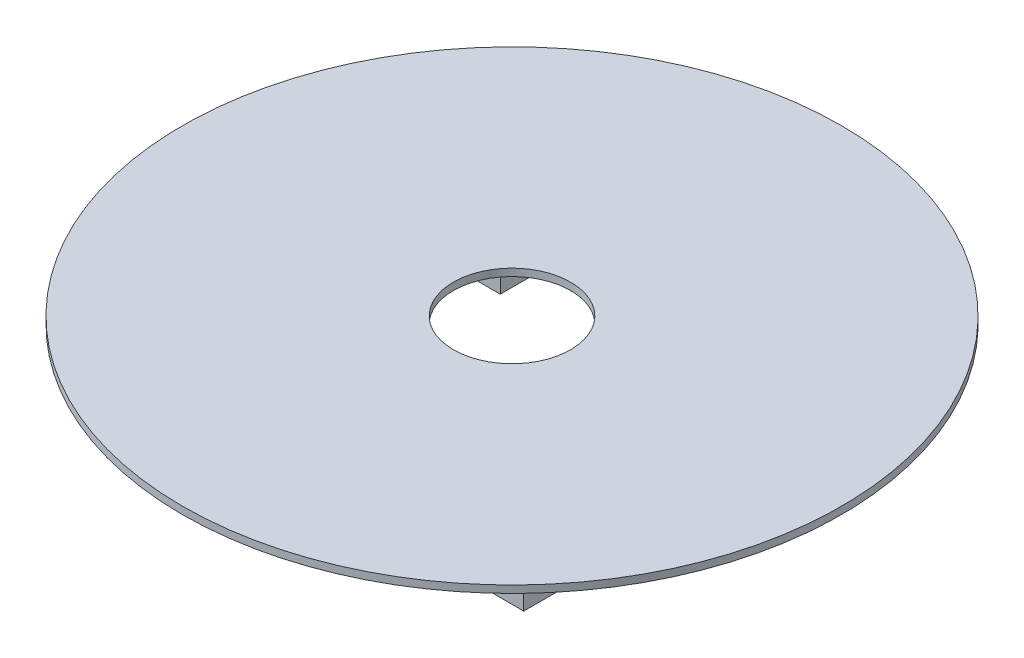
ISO-10303-21;
HEADER;
FILE_DESCRIPTION(('STEP AP214'),'2;1');
FILE_NAME('part.step','',(''),(''),'','','');
FILE_SCHEMA(('AUTOMOTIVE_DESIGN { 1 0 10303 214 1 1 1 1 }'));
ENDSEC;
DATA;
#1=APPLICATION_CONTEXT('core data for automotive mechanical design processes');
#2=APPLICATION_PROTOCOL_DEFINITION('international standard','automotive_design',2000,#1);
#3=PRODUCT_CONTEXT('',#1,'mechanical');
#4=PRODUCT('Part','Part','',(#3));
#5=PRODUCT_RELATED_PRODUCT_CATEGORY('part','',(#4));
#6=PRODUCT_DEFINITION_FORMATION('','',#4);
#7=PRODUCT_DEFINITION_CONTEXT('part definition',#1,'design');
#8=PRODUCT_DEFINITION('design','',#6,#7);
#9=PRODUCT_DEFINITION_SHAPE('','',#8);
#10=(LENGTH_UNIT() NAMED_UNIT(*) SI_UNIT(.MILLI.,.METRE.));
#11=(NAMED_UNIT(*) PLANE_ANGLE_UNIT() SI_UNIT($,.RADIAN.));
#12=(NAMED_UNIT(*) SI_UNIT($,.STERADIAN.) SOLID_ANGLE_UNIT());
#13=UNCERTAINTY_MEASURE_WITH_UNIT(LENGTH_MEASURE(1.E-05),#10,'distance_accuracy_value','');
#14=(GEOMETRIC_REPRESENTATION_CONTEXT(3) GLOBAL_UNCERTAINTY_ASSIGNED_CONTEXT((#13)) GLOBAL_UNIT_ASSIGNED_CONTEXT((#10,
#11,#12)) REPRESENTATION_CONTEXT('',''));
#15=CARTESIAN_POINT('',(0.,0.,0.));
#16=DIRECTION('',(0.,0.,1.));
#17=DIRECTION('',(1.,0.,0.));
#18=AXIS2_PLACEMENT_3D('',#15,#16,#17);
#19=CARTESIAN_POINT('',(0.,100.,0.));
#20=DIRECTION('',(0.,1.,0.));
#21=DIRECTION('',(0.,0.,1.));
#22=AXIS2_PLACEMENT_3D('',#19,#20,#21);
#23=PLANE('',#22);
#24=CARTESIAN_POINT('',(0.,100.,0.));
#25=DIRECTION('',(0.,1.,0.));
#26=DIRECTION('',(0.,0.,1.));
#27=AXIS2_PLACEMENT_3D('',#24,#25,#26);
#28=CIRCLE('',#27,4500.);
#29=CARTESIAN_POINT('',(0.,100.,4500.));
#30=VERTEX_POINT('',#29);
#31=EDGE_CURVE('E11',#30,#30,#28,.T.);
#32=ORIENTED_EDGE('',*,*,#31,.T.);
#33=EDGE_LOOP('',(#32));
#34=FACE_BOUND('',#33,.T.);
#35=CARTESIAN_POINT('',(0.,100.,0.));
#36=DIRECTION('',(0.,1.,0.));
#37=DIRECTION('',(0.,0.,1.));
#38=AXIS2_PLACEMENT_3D('',#35,#36,#37);
#39=CIRCLE('',#38,800.);
#40=CARTESIAN_POINT('',(0.,100.,800.));
#41=VERTEX_POINT('',#40);
#42=EDGE_CURVE('E290',#41,#41,#39,.T.);
#43=ORIENTED_EDGE('',*,*,#42,.F.);
#44=EDGE_LOOP('',(#43));
#45=FACE_BOUND('',#44,.T.);
#46=ADVANCED_FACE('F39',(#34,#45),#23,.T.);
#47=CARTESIAN_POINT('',(0.,0.,0.));
#48=DIRECTION('',(0.,1.,0.));
#49=DIRECTION('',(0.,0.,1.));
#50=AXIS2_PLACEMENT_3D('',#47,#48,#49);
#51=PLANE('',#50);
#52=DIRECTION('',(-1.,0.,0.));
#53=VECTOR('',#52,1.);
#54=CARTESIAN_POINT('',(627.106781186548,0.,787.106781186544));
#55=LINE('',#54,#53);
#56=CARTESIAN_POINT('',(3120.55915910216,0.,787.106781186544));
#57=VERTEX_POINT('',#56);
#58=CARTESIAN_POINT('',(627.106781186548,0.,787.106781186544));
#59=VERTEX_POINT('',#58);
#60=EDGE_CURVE('E232',#57,#59,#55,.T.);
#61=ORIENTED_EDGE('',*,*,#60,.T.);
#62=DIRECTION('',(0.,0.,1.));
#63=VECTOR('',#62,1.);
#64=CARTESIAN_POINT('',(627.106781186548,0.,787.106781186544));
#65=LINE('',#64,#63);
#66=CARTESIAN_POINT('',(627.106781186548,0.,2960.55915910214));
#67=VERTEX_POINT('',#66);
#68=EDGE_CURVE('E53',#59,#67,#65,.T.);
#69=ORIENTED_EDGE('',*,*,#68,.T.);
#70=DIRECTION('',(1.,0.,0.));
#71=VECTOR('',#70,1.);
#72=CARTESIAN_POINT('',(627.106781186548,0.,2960.55915910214));
#73=LINE('',#72,#71);
#74=CARTESIAN_POINT('',(3120.55915910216,0.,2960.55915910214));
#75=VERTEX_POINT('',#74);
#76=EDGE_CURVE('E238',#67,#75,#73,.T.);
#77=ORIENTED_EDGE('',*,*,#76,.T.);
#78=DIRECTION('',(0.,0.,-1.));
#79=VECTOR('',#78,1.);
#80=CARTESIAN_POINT('',(3120.55915910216,0.,787.106781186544));
#81=LINE('',#80,#79);
#82=EDGE_CURVE('E237',#75,#57,#81,.T.);
#83=ORIENTED_EDGE('',*,*,#82,.T.);
#84=EDGE_LOOP('',(#61,#69,#77,#83));
#85=FACE_BOUND('',#84,.T.);
#86=DIRECTION('',(1.,0.,0.));
#87=VECTOR('',#86,1.);
#88=CARTESIAN_POINT('',(-787.106781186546,0.,2960.55915910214));
#89=LINE('',#88,#87);
#90=CARTESIAN_POINT('',(-2960.55915910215,0.,2960.55915910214));
#91=VERTEX_POINT('',#90);
#92=CARTESIAN_POINT('',(-787.106781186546,0.,2960.55915910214));
#93=VERTEX_POINT('',#92);
#94=EDGE_CURVE('E201',#91,#93,#89,.T.);
#95=ORIENTED_EDGE('',*,*,#94,.T.);
#96=DIRECTION('',(0.,0.,-1.));
#97=VECTOR('',#96,1.);
#98=CARTESIAN_POINT('',(-787.106781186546,0.,787.106781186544));
#99=LINE('',#98,#97);
#100=CARTESIAN_POINT('',(-787.106781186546,0.,787.106781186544));
#101=VERTEX_POINT('',#100);
#102=EDGE_CURVE('E65',#93,#101,#99,.T.);
#103=ORIENTED_EDGE('',*,*,#102,.T.);
#104=DIRECTION('',(-1.,0.,0.));
#105=VECTOR('',#104,1.);
#106=CARTESIAN_POINT('',(-787.106781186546,0.,787.106781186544));
#107=LINE('',#106,#105);
#108=CARTESIAN_POINT('',(-2960.55915910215,0.,787.106781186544));
#109=VERTEX_POINT('',#108);
#110=EDGE_CURVE('E209',#101,#109,#107,.T.);
#111=ORIENTED_EDGE('',*,*,#110,.T.);
#112=DIRECTION('',(0.,0.,1.));
#113=VECTOR('',#112,1.);
#114=CARTESIAN_POINT('',(-2960.55915910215,0.,787.106781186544));
#115=LINE('',#114,#113);
#116=EDGE_CURVE('E206',#109,#91,#115,.T.);
#117=ORIENTED_EDGE('',*,*,#116,.T.);
#118=EDGE_LOOP('',(#95,#103,#111,#117));
#119=FACE_BOUND('',#118,.T.);
#120=DIRECTION('',(1.,0.,0.));
#121=VECTOR('',#120,1.);
#122=CARTESIAN_POINT('',(-787.106781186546,0.,-627.106781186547));
#123=LINE('',#122,#121);
#124=CARTESIAN_POINT('',(-2960.55915910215,0.,-627.106781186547));
#125=VERTEX_POINT('',#124);
#126=CARTESIAN_POINT('',(-787.106781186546,0.,-627.106781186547));
#127=VERTEX_POINT('',#126);
#128=EDGE_CURVE('E169',#125,#127,#123,.T.);
#129=ORIENTED_EDGE('',*,*,#128,.T.);
#130=DIRECTION('',(0.,0.,-1.));
#131=VECTOR('',#130,1.);
#132=CARTESIAN_POINT('',(-787.106781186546,0.,-627.106781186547));
#133=LINE('',#132,#131);
#134=CARTESIAN_POINT('',(-787.106781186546,0.,-3120.55915910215));
#135=VERTEX_POINT('',#134);
#136=EDGE_CURVE('E178',#127,#135,#133,.T.);
#137=ORIENTED_EDGE('',*,*,#136,.T.);
#138=DIRECTION('',(-1.,0.,0.));
#139=VECTOR('',#138,1.);
#140=CARTESIAN_POINT('',(-787.106781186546,0.,-3120.55915910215));
#141=LINE('',#140,#139);
#142=CARTESIAN_POINT('',(-2960.55915910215,0.,-3120.55915910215));
#143=VERTEX_POINT('',#142);
#144=EDGE_CURVE('E180',#135,#143,#141,.T.);
#145=ORIENTED_EDGE('',*,*,#144,.T.);
#146=DIRECTION('',(0.,0.,1.));
#147=VECTOR('',#146,1.);
#148=CARTESIAN_POINT('',(-2960.55915910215,0.,-627.106781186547));
#149=LINE('',#148,#147);
#150=EDGE_CURVE('E156',#143,#125,#149,.T.);
#151=ORIENTED_EDGE('',*,*,#150,.T.);
#152=EDGE_LOOP('',(#129,#137,#145,#151));
#153=FACE_BOUND('',#152,.T.);
#154=DIRECTION('',(-1.,0.,0.));
#155=VECTOR('',#154,1.);
#156=CARTESIAN_POINT('',(627.106781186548,0.,-3120.55915910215));
#157=LINE('',#156,#155);
#158=CARTESIAN_POINT('',(3120.55915910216,0.,-3120.55915910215));
#159=VERTEX_POINT('',#158);
#160=CARTESIAN_POINT('',(627.106781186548,0.,-3120.55915910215));
#161=VERTEX_POINT('',#160);
#162=EDGE_CURVE('E256',#159,#161,#157,.T.);
#163=ORIENTED_EDGE('',*,*,#162,.T.);
#164=DIRECTION('',(0.,0.,1.));
#165=VECTOR('',#164,1.);
#166=CARTESIAN_POINT('',(627.106781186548,0.,-627.106781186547));
#167=LINE('',#166,#165);
#168=CARTESIAN_POINT('',(627.106781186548,0.,-627.106781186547));
#169=VERTEX_POINT('',#168);
#170=EDGE_CURVE('E184',#161,#169,#167,.T.);
#171=ORIENTED_EDGE('',*,*,#170,.T.);
#172=DIRECTION('',(1.,0.,0.));
#173=VECTOR('',#172,1.);
#174=CARTESIAN_POINT('',(627.106781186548,0.,-627.106781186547));
#175=LINE('',#174,#173);
#176=CARTESIAN_POINT('',(3120.55915910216,0.,-627.106781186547));
#177=VERTEX_POINT('',#176);
#178=EDGE_CURVE('E269',#169,#177,#175,.T.);
#179=ORIENTED_EDGE('',*,*,#178,.T.);
#180=DIRECTION('',(0.,0.,-1.));
#181=VECTOR('',#180,1.);
#182=CARTESIAN_POINT('',(3120.55915910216,0.,-627.106781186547));
#183=LINE('',#182,#181);
#184=EDGE_CURVE('E272',#177,#159,#183,.T.);
#185=ORIENTED_EDGE('',*,*,#184,.T.);
#186=EDGE_LOOP('',(#163,#171,#179,#185));
#187=FACE_BOUND('',#186,.T.);
#188=CARTESIAN_POINT('',(0.,0.,0.));
#189=DIRECTION('',(0.,1.,0.));
#190=DIRECTION('',(0.,0.,1.));
#191=AXIS2_PLACEMENT_3D('',#188,#189,#190);
#192=CIRCLE('',#191,4500.);
#193=CARTESIAN_POINT('',(0.,0.,4500.));
#194=VERTEX_POINT('',#193);
#195=EDGE_CURVE('E43',#194,#194,#192,.T.);
#196=ORIENTED_EDGE('',*,*,#195,.F.);
#197=EDGE_LOOP('',(#196));
#198=FACE_BOUND('',#197,.T.);
#199=CARTESIAN_POINT('',(0.,0.,0.));
#200=DIRECTION('',(0.,1.,0.));
#201=DIRECTION('',(0.,0.,1.));
#202=AXIS2_PLACEMENT_3D('',#199,#200,#201);
#203=CIRCLE('',#202,800.);
#204=CARTESIAN_POINT('',(0.,0.,800.));
#205=VERTEX_POINT('',#204);
#206=EDGE_CURVE('E281',#205,#205,#203,.T.);
#207=ORIENTED_EDGE('',*,*,#206,.T.);
#208=EDGE_LOOP('',(#207));
#209=FACE_BOUND('',#208,.T.);
#210=ADVANCED_FACE('F173',(#85,#119,#153,#187,#198,#209),#51,.F.);
#211=CARTESIAN_POINT('',(0.,100.,0.));
#212=DIRECTION('',(0.,-1.,0.));
#213=DIRECTION('',(0.,0.,-1.));
#214=AXIS2_PLACEMENT_3D('',#211,#212,#213);
#215=CYLINDRICAL_SURFACE('',#214,4500.);
#216=ORIENTED_EDGE('',*,*,#31,.F.);
#217=EDGE_LOOP('',(#216));
#218=FACE_BOUND('',#217,.T.);
#219=ORIENTED_EDGE('',*,*,#195,.T.);
#220=EDGE_LOOP('',(#219));
#221=FACE_BOUND('',#220,.T.);
#222=ADVANCED_FACE('F41',(#218,#221),#215,.T.);
#223=CARTESIAN_POINT('',(0.,100.,0.));
#224=DIRECTION('',(0.,-1.,0.));
#225=DIRECTION('',(0.,0.,-1.));
#226=AXIS2_PLACEMENT_3D('',#223,#224,#225);
#227=CYLINDRICAL_SURFACE('',#226,800.);
#228=ORIENTED_EDGE('',*,*,#42,.T.);
#229=EDGE_LOOP('',(#228));
#230=FACE_BOUND('',#229,.T.);
#231=ORIENTED_EDGE('',*,*,#206,.F.);
#232=EDGE_LOOP('',(#231));
#233=FACE_BOUND('',#232,.T.);
#234=ADVANCED_FACE('F294',(#230,#233),#227,.F.);
#235=CARTESIAN_POINT('',(627.106781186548,-350.,-627.106781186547));
#236=DIRECTION('',(-1.,0.,0.));
#237=DIRECTION('',(0.,0.,1.));
#238=AXIS2_PLACEMENT_3D('',#235,#236,#237);
#239=PLANE('',#238);
#240=ORIENTED_EDGE('',*,*,#170,.F.);
#241=DIRECTION('',(0.,1.,0.));
#242=VECTOR('',#241,1.);
#243=CARTESIAN_POINT('',(627.106781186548,-350.,-3120.55915910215));
#244=LINE('',#243,#242);
#245=CARTESIAN_POINT('',(627.106781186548,-350.,-3120.55915910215));
#246=VERTEX_POINT('',#245);
#247=EDGE_CURVE('E279',#246,#161,#244,.T.);
#248=ORIENTED_EDGE('',*,*,#247,.F.);
#249=DIRECTION('',(0.,0.,1.));
#250=VECTOR('',#249,1.);
#251=CARTESIAN_POINT('',(627.106781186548,-350.,-627.106781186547));
#252=LINE('',#251,#250);
#253=CARTESIAN_POINT('',(627.106781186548,-350.,-627.106781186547));
#254=VERTEX_POINT('',#253);
#255=EDGE_CURVE('E255',#246,#254,#252,.T.);
#256=ORIENTED_EDGE('',*,*,#255,.T.);
#257=DIRECTION('',(0.,1.,0.));
#258=VECTOR('',#257,1.);
#259=CARTESIAN_POINT('',(627.106781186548,-350.,-627.106781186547));
#260=LINE('',#259,#258);
#261=EDGE_CURVE('E270',#254,#169,#260,.T.);
#262=ORIENTED_EDGE('',*,*,#261,.T.);
#263=EDGE_LOOP('',(#240,#248,#256,#262));
#264=FACE_BOUND('',#263,.T.);
#265=ADVANCED_FACE('F296',(#264),#239,.T.);
#266=CARTESIAN_POINT('',(627.106781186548,-350.,-3120.55915910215));
#267=DIRECTION('',(0.,0.,-1.));
#268=DIRECTION('',(-1.,0.,0.));
#269=AXIS2_PLACEMENT_3D('',#266,#267,#268);
#270=PLANE('',#269);
#271=ORIENTED_EDGE('',*,*,#162,.F.);
#272=DIRECTION('',(0.,1.,0.));
#273=VECTOR('',#272,1.);
#274=CARTESIAN_POINT('',(3120.55915910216,-350.,-3120.55915910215));
#275=LINE('',#274,#273);
#276=CARTESIAN_POINT('',(3120.55915910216,-350.,-3120.55915910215));
#277=VERTEX_POINT('',#276);
#278=EDGE_CURVE('E285',#277,#159,#275,.T.);
#279=ORIENTED_EDGE('',*,*,#278,.F.);
#280=DIRECTION('',(-1.,0.,0.));
#281=VECTOR('',#280,1.);
#282=CARTESIAN_POINT('',(627.106781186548,-350.,-3120.55915910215));
#283=LINE('',#282,#281);
#284=EDGE_CURVE('E262',#277,#246,#283,.T.);
#285=ORIENTED_EDGE('',*,*,#284,.T.);
#286=ORIENTED_EDGE('',*,*,#247,.T.);
#287=EDGE_LOOP('',(#271,#279,#285,#286));
#288=FACE_BOUND('',#287,.T.);
#289=ADVANCED_FACE('F303',(#288),#270,.T.);
#290=CARTESIAN_POINT('',(3120.55915910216,-350.,-627.106781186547));
#291=DIRECTION('',(1.,0.,0.));
#292=DIRECTION('',(0.,0.,-1.));
#293=AXIS2_PLACEMENT_3D('',#290,#291,#292);
#294=PLANE('',#293);
#295=ORIENTED_EDGE('',*,*,#184,.F.);
#296=DIRECTION('',(0.,1.,0.));
#297=VECTOR('',#296,1.);
#298=CARTESIAN_POINT('',(3120.55915910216,-350.,-627.106781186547));
#299=LINE('',#298,#297);
#300=CARTESIAN_POINT('',(3120.55915910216,-350.,-627.106781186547));
#301=VERTEX_POINT('',#300);
#302=EDGE_CURVE('E283',#301,#177,#299,.T.);
#303=ORIENTED_EDGE('',*,*,#302,.F.);
#304=DIRECTION('',(0.,0.,-1.));
#305=VECTOR('',#304,1.);
#306=CARTESIAN_POINT('',(3120.55915910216,-350.,-627.106781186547));
#307=LINE('',#306,#305);
#308=EDGE_CURVE('E261',#301,#277,#307,.T.);
#309=ORIENTED_EDGE('',*,*,#308,.T.);
#310=ORIENTED_EDGE('',*,*,#278,.T.);
#311=EDGE_LOOP('',(#295,#303,#309,#310));
#312=FACE_BOUND('',#311,.T.);
#313=ADVANCED_FACE('F379',(#312),#294,.T.);
#314=CARTESIAN_POINT('',(627.106781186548,-350.,-627.106781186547));
#315=DIRECTION('',(0.,0.,1.));
#316=DIRECTION('',(1.,0.,0.));
#317=AXIS2_PLACEMENT_3D('',#314,#315,#316);
#318=PLANE('',#317);
#319=ORIENTED_EDGE('',*,*,#178,.F.);
#320=ORIENTED_EDGE('',*,*,#261,.F.);
#321=DIRECTION('',(1.,0.,0.));
#322=VECTOR('',#321,1.);
#323=CARTESIAN_POINT('',(627.106781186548,-350.,-627.106781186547));
#324=LINE('',#323,#322);
#325=EDGE_CURVE('E260',#254,#301,#324,.T.);
#326=ORIENTED_EDGE('',*,*,#325,.T.);
#327=ORIENTED_EDGE('',*,*,#302,.T.);
#328=EDGE_LOOP('',(#319,#320,#326,#327));
#329=FACE_BOUND('',#328,.T.);
#330=ADVANCED_FACE('F376',(#329),#318,.T.);
#331=CARTESIAN_POINT('',(0.,-350.,0.));
#332=DIRECTION('',(0.,-1.,0.));
#333=DIRECTION('',(0.,0.,-1.));
#334=AXIS2_PLACEMENT_3D('',#331,#332,#333);
#335=PLANE('',#334);
#336=ORIENTED_EDGE('',*,*,#255,.F.);
#337=ORIENTED_EDGE('',*,*,#284,.F.);
#338=ORIENTED_EDGE('',*,*,#308,.F.);
#339=ORIENTED_EDGE('',*,*,#325,.F.);
#340=EDGE_LOOP('',(#336,#337,#338,#339));
#341=FACE_BOUND('',#340,.T.);
#342=ADVANCED_FACE('F375',(#341),#335,.T.);
#343=CARTESIAN_POINT('',(-787.106781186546,-350.,-627.106781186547));
#344=DIRECTION('',(1.,0.,0.));
#345=DIRECTION('',(0.,0.,-1.));
#346=AXIS2_PLACEMENT_3D('',#343,#344,#345);
#347=PLANE('',#346);
#348=ORIENTED_EDGE('',*,*,#136,.F.);
#349=DIRECTION('',(0.,1.,0.));
#350=VECTOR('',#349,1.);
#351=CARTESIAN_POINT('',(-787.106781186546,-350.,-627.106781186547));
#352=LINE('',#351,#350);
#353=CARTESIAN_POINT('',(-787.106781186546,-350.,-627.106781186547));
#354=VERTEX_POINT('',#353);
#355=EDGE_CURVE('E163',#354,#127,#352,.T.);
#356=ORIENTED_EDGE('',*,*,#355,.F.);
#357=DIRECTION('',(0.,0.,-1.));
#358=VECTOR('',#357,1.);
#359=CARTESIAN_POINT('',(-787.106781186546,-350.,-627.106781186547));
#360=LINE('',#359,#358);
#361=CARTESIAN_POINT('',(-787.106781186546,-350.,-3120.55915910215));
#362=VERTEX_POINT('',#361);
#363=EDGE_CURVE('E175',#354,#362,#360,.T.);
#364=ORIENTED_EDGE('',*,*,#363,.T.);
#365=DIRECTION('',(0.,1.,0.));
#366=VECTOR('',#365,1.);
#367=CARTESIAN_POINT('',(-787.106781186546,-350.,-3120.55915910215));
#368=LINE('',#367,#366);
#369=EDGE_CURVE('E190',#362,#135,#368,.T.);
#370=ORIENTED_EDGE('',*,*,#369,.T.);
#371=EDGE_LOOP('',(#348,#356,#364,#370));
#372=FACE_BOUND('',#371,.T.);
#373=ADVANCED_FACE('F374',(#372),#347,.T.);
#374=CARTESIAN_POINT('',(-787.106781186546,-350.,-627.106781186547));
#375=DIRECTION('',(0.,0.,1.));
#376=DIRECTION('',(1.,0.,0.));
#377=AXIS2_PLACEMENT_3D('',#374,#375,#376);
#378=PLANE('',#377);
#379=ORIENTED_EDGE('',*,*,#128,.F.);
#380=DIRECTION('',(0.,1.,0.));
#381=VECTOR('',#380,1.);
#382=CARTESIAN_POINT('',(-2960.55915910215,-350.,-627.106781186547));
#383=LINE('',#382,#381);
#384=CARTESIAN_POINT('',(-2960.55915910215,-350.,-627.106781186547));
#385=VERTEX_POINT('',#384);
#386=EDGE_CURVE('E155',#385,#125,#383,.T.);
#387=ORIENTED_EDGE('',*,*,#386,.F.);
#388=DIRECTION('',(1.,0.,0.));
#389=VECTOR('',#388,1.);
#390=CARTESIAN_POINT('',(-787.106781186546,-350.,-627.106781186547));
#391=LINE('',#390,#389);
#392=EDGE_CURVE('E183',#385,#354,#391,.T.);
#393=ORIENTED_EDGE('',*,*,#392,.T.);
#394=ORIENTED_EDGE('',*,*,#355,.T.);
#395=EDGE_LOOP('',(#379,#387,#393,#394));
#396=FACE_BOUND('',#395,.T.);
#397=ADVANCED_FACE('F166',(#396),#378,.T.);
#398=CARTESIAN_POINT('',(-2960.55915910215,-350.,-627.106781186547));
#399=DIRECTION('',(-1.,0.,0.));
#400=DIRECTION('',(0.,0.,1.));
#401=AXIS2_PLACEMENT_3D('',#398,#399,#400);
#402=PLANE('',#401);
#403=ORIENTED_EDGE('',*,*,#150,.F.);
#404=DIRECTION('',(0.,1.,0.));
#405=VECTOR('',#404,1.);
#406=CARTESIAN_POINT('',(-2960.55915910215,-350.,-3120.55915910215));
#407=LINE('',#406,#405);
#408=CARTESIAN_POINT('',(-2960.55915910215,-350.,-3120.55915910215));
#409=VERTEX_POINT('',#408);
#410=EDGE_CURVE('E162',#409,#143,#407,.T.);
#411=ORIENTED_EDGE('',*,*,#410,.F.);
#412=DIRECTION('',(0.,0.,1.));
#413=VECTOR('',#412,1.);
#414=CARTESIAN_POINT('',(-2960.55915910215,-350.,-627.106781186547));
#415=LINE('',#414,#413);
#416=EDGE_CURVE('E157',#409,#385,#415,.T.);
#417=ORIENTED_EDGE('',*,*,#416,.T.);
#418=ORIENTED_EDGE('',*,*,#386,.T.);
#419=EDGE_LOOP('',(#403,#411,#417,#418));
#420=FACE_BOUND('',#419,.T.);
#421=ADVANCED_FACE('F152',(#420),#402,.T.);
#422=CARTESIAN_POINT('',(-787.106781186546,-350.,-3120.55915910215));
#423=DIRECTION('',(0.,0.,-1.));
#424=DIRECTION('',(-1.,0.,0.));
#425=AXIS2_PLACEMENT_3D('',#422,#423,#424);
#426=PLANE('',#425);
#427=ORIENTED_EDGE('',*,*,#144,.F.);
#428=ORIENTED_EDGE('',*,*,#369,.F.);
#429=DIRECTION('',(-1.,0.,0.));
#430=VECTOR('',#429,1.);
#431=CARTESIAN_POINT('',(-787.106781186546,-350.,-3120.55915910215));
#432=LINE('',#431,#430);
#433=EDGE_CURVE('E188',#362,#409,#432,.T.);
#434=ORIENTED_EDGE('',*,*,#433,.T.);
#435=ORIENTED_EDGE('',*,*,#410,.T.);
#436=EDGE_LOOP('',(#427,#428,#434,#435));
#437=FACE_BOUND('',#436,.T.);
#438=ADVANCED_FACE('F422',(#437),#426,.T.);
#439=CARTESIAN_POINT('',(0.,-350.,0.));
#440=DIRECTION('',(0.,1.,0.));
#441=DIRECTION('',(0.,0.,1.));
#442=AXIS2_PLACEMENT_3D('',#439,#440,#441);
#443=PLANE('',#442);
#444=ORIENTED_EDGE('',*,*,#363,.F.);
#445=ORIENTED_EDGE('',*,*,#392,.F.);
#446=ORIENTED_EDGE('',*,*,#416,.F.);
#447=ORIENTED_EDGE('',*,*,#433,.F.);
#448=EDGE_LOOP('',(#444,#445,#446,#447));
#449=FACE_BOUND('',#448,.T.);
#450=ADVANCED_FACE('F433',(#449),#443,.F.);
#451=CARTESIAN_POINT('',(-787.106781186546,-350.,787.106781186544));
#452=DIRECTION('',(1.,0.,0.));
#453=DIRECTION('',(0.,0.,-1.));
#454=AXIS2_PLACEMENT_3D('',#451,#452,#453);
#455=PLANE('',#454);
#456=ORIENTED_EDGE('',*,*,#102,.F.);
#457=DIRECTION('',(0.,1.,0.));
#458=VECTOR('',#457,1.);
#459=CARTESIAN_POINT('',(-787.106781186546,-350.,2960.55915910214));
#460=LINE('',#459,#458);
#461=CARTESIAN_POINT('',(-787.106781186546,-350.,2960.55915910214));
#462=VERTEX_POINT('',#461);
#463=EDGE_CURVE('E203',#462,#93,#460,.T.);
#464=ORIENTED_EDGE('',*,*,#463,.F.);
#465=DIRECTION('',(0.,0.,-1.));
#466=VECTOR('',#465,1.);
#467=CARTESIAN_POINT('',(-787.106781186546,-350.,787.106781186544));
#468=LINE('',#467,#466);
#469=CARTESIAN_POINT('',(-787.106781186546,-350.,787.106781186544));
#470=VERTEX_POINT('',#469);
#471=EDGE_CURVE('E210',#462,#470,#468,.T.);
#472=ORIENTED_EDGE('',*,*,#471,.T.);
#473=DIRECTION('',(0.,1.,0.));
#474=VECTOR('',#473,1.);
#475=CARTESIAN_POINT('',(-787.106781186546,-350.,787.106781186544));
#476=LINE('',#475,#474);
#477=EDGE_CURVE('E193',#470,#101,#476,.T.);
#478=ORIENTED_EDGE('',*,*,#477,.T.);
#479=EDGE_LOOP('',(#456,#464,#472,#478));
#480=FACE_BOUND('',#479,.T.);
#481=ADVANCED_FACE('F332',(#480),#455,.T.);
#482=CARTESIAN_POINT('',(-787.106781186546,-350.,2960.55915910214));
#483=DIRECTION('',(0.,0.,1.));
#484=DIRECTION('',(1.,0.,0.));
#485=AXIS2_PLACEMENT_3D('',#482,#483,#484);
#486=PLANE('',#485);
#487=ORIENTED_EDGE('',*,*,#94,.F.);
#488=DIRECTION('',(0.,1.,0.));
#489=VECTOR('',#488,1.);
#490=CARTESIAN_POINT('',(-2960.55915910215,-350.,2960.55915910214));
#491=LINE('',#490,#489);
#492=CARTESIAN_POINT('',(-2960.55915910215,-350.,2960.55915910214));
#493=VERTEX_POINT('',#492);
#494=EDGE_CURVE('E200',#493,#91,#491,.T.);
#495=ORIENTED_EDGE('',*,*,#494,.F.);
#496=DIRECTION('',(1.,0.,0.));
#497=VECTOR('',#496,1.);
#498=CARTESIAN_POINT('',(-787.106781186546,-350.,2960.55915910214));
#499=LINE('',#498,#497);
#500=EDGE_CURVE('E198',#493,#462,#499,.T.);
#501=ORIENTED_EDGE('',*,*,#500,.T.);
#502=ORIENTED_EDGE('',*,*,#463,.T.);
#503=EDGE_LOOP('',(#487,#495,#501,#502));
#504=FACE_BOUND('',#503,.T.);
#505=ADVANCED_FACE('F327',(#504),#486,.T.);
#506=CARTESIAN_POINT('',(-2960.55915910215,-350.,787.106781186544));
#507=DIRECTION('',(-1.,0.,0.));
#508=DIRECTION('',(0.,0.,1.));
#509=AXIS2_PLACEMENT_3D('',#506,#507,#508);
#510=PLANE('',#509);
#511=ORIENTED_EDGE('',*,*,#116,.F.);
#512=DIRECTION('',(0.,1.,0.));
#513=VECTOR('',#512,1.);
#514=CARTESIAN_POINT('',(-2960.55915910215,-350.,787.106781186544));
#515=LINE('',#514,#513);
#516=CARTESIAN_POINT('',(-2960.55915910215,-350.,787.106781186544));
#517=VERTEX_POINT('',#516);
#518=EDGE_CURVE('E197',#517,#109,#515,.T.);
#519=ORIENTED_EDGE('',*,*,#518,.F.);
#520=DIRECTION('',(0.,0.,1.));
#521=VECTOR('',#520,1.);
#522=CARTESIAN_POINT('',(-2960.55915910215,-350.,787.106781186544));
#523=LINE('',#522,#521);
#524=EDGE_CURVE('E216',#517,#493,#523,.T.);
#525=ORIENTED_EDGE('',*,*,#524,.T.);
#526=ORIENTED_EDGE('',*,*,#494,.T.);
#527=EDGE_LOOP('',(#511,#519,#525,#526));
#528=FACE_BOUND('',#527,.T.);
#529=ADVANCED_FACE('F339',(#528),#510,.T.);
#530=CARTESIAN_POINT('',(-787.106781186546,-350.,787.106781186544));
#531=DIRECTION('',(0.,0.,-1.));
#532=DIRECTION('',(-1.,0.,0.));
#533=AXIS2_PLACEMENT_3D('',#530,#531,#532);
#534=PLANE('',#533);
#535=ORIENTED_EDGE('',*,*,#110,.F.);
#536=ORIENTED_EDGE('',*,*,#477,.F.);
#537=DIRECTION('',(-1.,0.,0.));
#538=VECTOR('',#537,1.);
#539=CARTESIAN_POINT('',(-787.106781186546,-350.,787.106781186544));
#540=LINE('',#539,#538);
#541=EDGE_CURVE('E218',#470,#517,#540,.T.);
#542=ORIENTED_EDGE('',*,*,#541,.T.);
#543=ORIENTED_EDGE('',*,*,#518,.T.);
#544=EDGE_LOOP('',(#535,#536,#542,#543));
#545=FACE_BOUND('',#544,.T.);
#546=ADVANCED_FACE('F337',(#545),#534,.T.);
#547=CARTESIAN_POINT('',(0.,-350.,0.));
#548=DIRECTION('',(0.,-1.,0.));
#549=DIRECTION('',(0.,0.,-1.));
#550=AXIS2_PLACEMENT_3D('',#547,#548,#549);
#551=PLANE('',#550);
#552=ORIENTED_EDGE('',*,*,#471,.F.);
#553=ORIENTED_EDGE('',*,*,#500,.F.);
#554=ORIENTED_EDGE('',*,*,#524,.F.);
#555=ORIENTED_EDGE('',*,*,#541,.F.);
#556=EDGE_LOOP('',(#552,#553,#554,#555));
#557=FACE_BOUND('',#556,.T.);
#558=ADVANCED_FACE('F331',(#557),#551,.T.);
#559=CARTESIAN_POINT('',(627.106781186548,-350.,787.106781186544));
#560=DIRECTION('',(-1.,0.,0.));
#561=DIRECTION('',(0.,0.,1.));
#562=AXIS2_PLACEMENT_3D('',#559,#560,#561);
#563=PLANE('',#562);
#564=ORIENTED_EDGE('',*,*,#68,.F.);
#565=DIRECTION('',(0.,1.,0.));
#566=VECTOR('',#565,1.);
#567=CARTESIAN_POINT('',(627.106781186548,-350.,787.106781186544));
#568=LINE('',#567,#566);
#569=CARTESIAN_POINT('',(627.106781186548,-350.,787.106781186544));
#570=VERTEX_POINT('',#569);
#571=EDGE_CURVE('E231',#570,#59,#568,.T.);
#572=ORIENTED_EDGE('',*,*,#571,.F.);
#573=DIRECTION('',(0.,0.,1.));
#574=VECTOR('',#573,1.);
#575=CARTESIAN_POINT('',(627.106781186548,-350.,787.106781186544));
#576=LINE('',#575,#574);
#577=CARTESIAN_POINT('',(627.106781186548,-350.,2960.55915910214));
#578=VERTEX_POINT('',#577);
#579=EDGE_CURVE('E240',#570,#578,#576,.T.);
#580=ORIENTED_EDGE('',*,*,#579,.T.);
#581=DIRECTION('',(0.,1.,0.));
#582=VECTOR('',#581,1.);
#583=CARTESIAN_POINT('',(627.106781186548,-350.,2960.55915910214));
#584=LINE('',#583,#582);
#585=EDGE_CURVE('E221',#578,#67,#584,.T.);
#586=ORIENTED_EDGE('',*,*,#585,.T.);
#587=EDGE_LOOP('',(#564,#572,#580,#586));
#588=FACE_BOUND('',#587,.T.);
#589=ADVANCED_FACE('F352',(#588),#563,.T.);
#590=CARTESIAN_POINT('',(627.106781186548,-350.,787.106781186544));
#591=DIRECTION('',(0.,0.,-1.));
#592=DIRECTION('',(-1.,0.,0.));
#593=AXIS2_PLACEMENT_3D('',#590,#591,#592);
#594=PLANE('',#593);
#595=ORIENTED_EDGE('',*,*,#60,.F.);
#596=DIRECTION('',(0.,1.,0.));
#597=VECTOR('',#596,1.);
#598=CARTESIAN_POINT('',(3120.55915910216,-350.,787.106781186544));
#599=LINE('',#598,#597);
#600=CARTESIAN_POINT('',(3120.55915910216,-350.,787.106781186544));
#601=VERTEX_POINT('',#600);
#602=EDGE_CURVE('E228',#601,#57,#599,.T.);
#603=ORIENTED_EDGE('',*,*,#602,.F.);
#604=DIRECTION('',(-1.,0.,0.));
#605=VECTOR('',#604,1.);
#606=CARTESIAN_POINT('',(627.106781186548,-350.,787.106781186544));
#607=LINE('',#606,#605);
#608=EDGE_CURVE('E226',#601,#570,#607,.T.);
#609=ORIENTED_EDGE('',*,*,#608,.T.);
#610=ORIENTED_EDGE('',*,*,#571,.T.);
#611=EDGE_LOOP('',(#595,#603,#609,#610));
#612=FACE_BOUND('',#611,.T.);
#613=ADVANCED_FACE('F356',(#612),#594,.T.);
#614=CARTESIAN_POINT('',(3120.55915910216,-350.,787.106781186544));
#615=DIRECTION('',(1.,0.,0.));
#616=DIRECTION('',(0.,0.,-1.));
#617=AXIS2_PLACEMENT_3D('',#614,#615,#616);
#618=PLANE('',#617);
#619=ORIENTED_EDGE('',*,*,#82,.F.);
#620=DIRECTION('',(0.,1.,0.));
#621=VECTOR('',#620,1.);
#622=CARTESIAN_POINT('',(3120.55915910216,-350.,2960.55915910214));
#623=LINE('',#622,#621);
#624=CARTESIAN_POINT('',(3120.55915910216,-350.,2960.55915910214));
#625=VERTEX_POINT('',#624);
#626=EDGE_CURVE('E230',#625,#75,#623,.T.);
#627=ORIENTED_EDGE('',*,*,#626,.F.);
#628=DIRECTION('',(0.,0.,-1.));
#629=VECTOR('',#628,1.);
#630=CARTESIAN_POINT('',(3120.55915910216,-350.,787.106781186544));
#631=LINE('',#630,#629);
#632=EDGE_CURVE('E246',#625,#601,#631,.T.);
#633=ORIENTED_EDGE('',*,*,#632,.T.);
#634=ORIENTED_EDGE('',*,*,#602,.T.);
#635=EDGE_LOOP('',(#619,#627,#633,#634));
#636=FACE_BOUND('',#635,.T.);
#637=ADVANCED_FACE('F363',(#636),#618,.T.);
#638=CARTESIAN_POINT('',(627.106781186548,-350.,2960.55915910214));
#639=DIRECTION('',(0.,0.,1.));
#640=DIRECTION('',(1.,0.,0.));
#641=AXIS2_PLACEMENT_3D('',#638,#639,#640);
#642=PLANE('',#641);
#643=ORIENTED_EDGE('',*,*,#76,.F.);
#644=ORIENTED_EDGE('',*,*,#585,.F.);
#645=DIRECTION('',(1.,0.,0.));
#646=VECTOR('',#645,1.);
#647=CARTESIAN_POINT('',(627.106781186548,-350.,2960.55915910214));
#648=LINE('',#647,#646);
#649=EDGE_CURVE('E248',#578,#625,#648,.T.);
#650=ORIENTED_EDGE('',*,*,#649,.T.);
#651=ORIENTED_EDGE('',*,*,#626,.T.);
#652=EDGE_LOOP('',(#643,#644,#650,#651));
#653=FACE_BOUND('',#652,.T.);
#654=ADVANCED_FACE('F360',(#653),#642,.T.);
#655=CARTESIAN_POINT('',(0.,-350.,0.));
#656=DIRECTION('',(0.,1.,0.));
#657=DIRECTION('',(0.,0.,1.));
#658=AXIS2_PLACEMENT_3D('',#655,#656,#657);
#659=PLANE('',#658);
#660=ORIENTED_EDGE('',*,*,#579,.F.);
#661=ORIENTED_EDGE('',*,*,#608,.F.);
#662=ORIENTED_EDGE('',*,*,#632,.F.);
#663=ORIENTED_EDGE('',*,*,#649,.F.);
#664=EDGE_LOOP('',(#660,#661,#662,#663));
#665=FACE_BOUND('',#664,.T.);
#666=ADVANCED_FACE('F359',(#665),#659,.F.);
#667=CLOSED_SHELL('',(#46,#210,#222,#234,#265,#289,#313,#330,#342,#373,#397,#421,#438,#450,#481,
#505,#529,#546,#558,#589,#613,#637,#654,#666));
#668=MANIFOLD_SOLID_BREP('B2',#667);
#669=ADVANCED_BREP_SHAPE_REPRESENTATION('',(#18,#668),#14);
#670=SHAPE_DEFINITION_REPRESENTATION(#9,#669);
ENDSEC;
END-ISO-10303-21;
